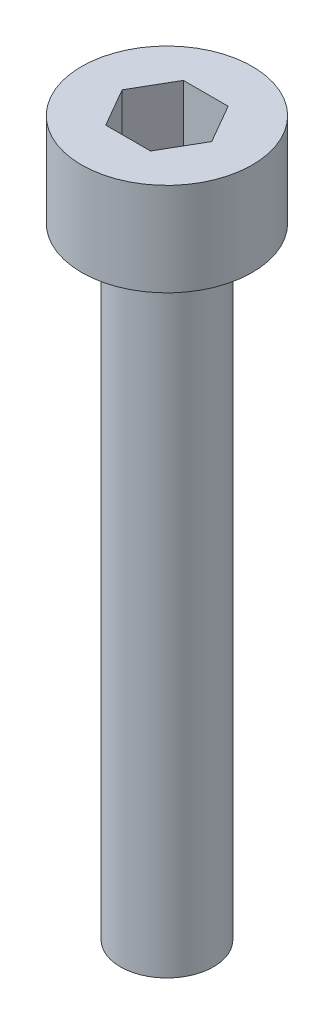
from build123d import *

# Parameters (mm, degrees)
CUT_EXTRUDE1_DEPTH = 2.5


with BuildPart() as part:
    # profiile → Base-Revolve (revolve)
    with BuildSketch(Plane.XY, mode=Mode.PRIVATE) as base_revolve_sk:
        Polygon((0, 3), (2.75, 3), (2.75, 0), (1.5, 0), (1.5, -20), (0, -20), align=None)
    revolve(base_revolve_sk.sketch.rotate(Axis((0, 9.907210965, 0), (0, -1, 0)), 90), axis=Axis((0, 9.907210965, 0), (0, -1, 0)))

    # Sketch1 → Cut-Extrude1 (cut)
    with BuildSketch(Plane(origin=(0, 3, 0), x_dir=(1, 0, 0), z_dir=(0, 1, 0))):
        Polygon((1.443375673, 0), (0.721687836, 1.25), (-0.721687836, 1.25), (-1.443375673, 0), (-0.721687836, -1.25), (0.721687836, -1.25), align=None)
    extrude(amount=-CUT_EXTRUDE1_DEPTH, mode=Mode.SUBTRACT)


solid = part.part
